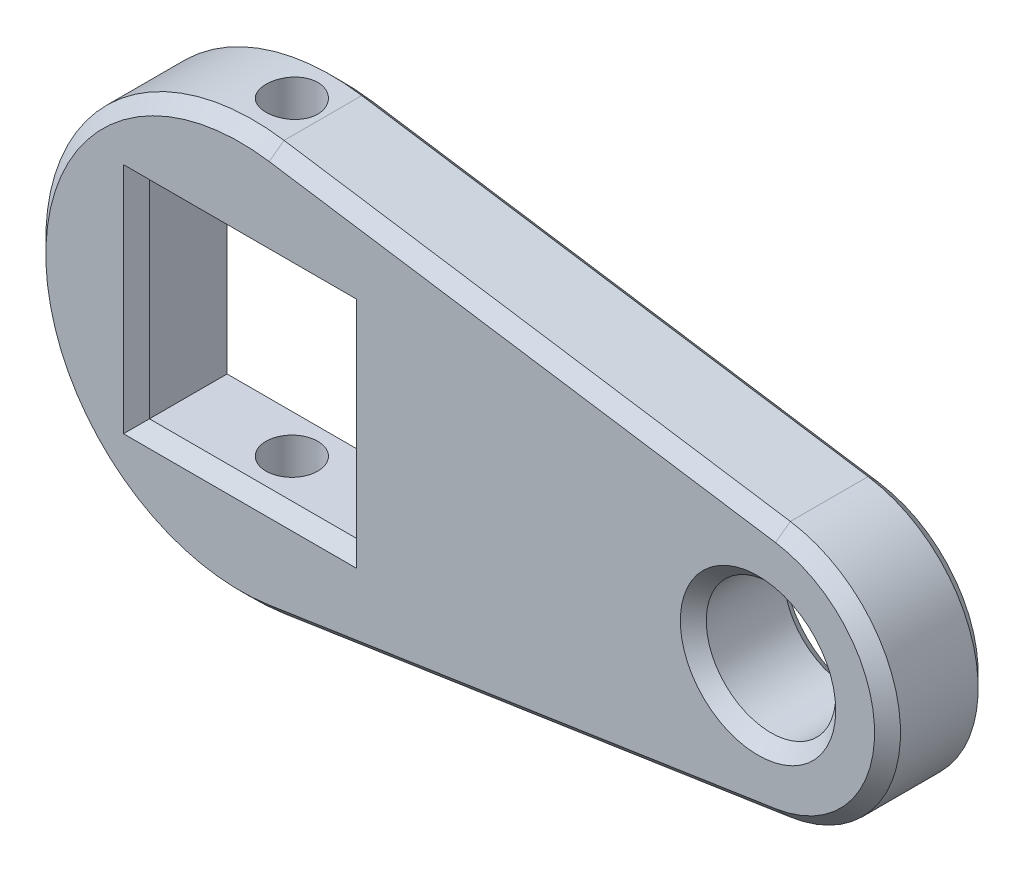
ISO-10303-21;
HEADER;
FILE_DESCRIPTION(('STEP AP214'),'2;1');
FILE_NAME('part.step','',(''),(''),'','','');
FILE_SCHEMA(('AUTOMOTIVE_DESIGN { 1 0 10303 214 1 1 1 1 }'));
ENDSEC;
DATA;
#1=APPLICATION_CONTEXT('core data for automotive mechanical design processes');
#2=APPLICATION_PROTOCOL_DEFINITION('international standard','automotive_design',2000,#1);
#3=PRODUCT_CONTEXT('',#1,'mechanical');
#4=PRODUCT('Part','Part','',(#3));
#5=PRODUCT_RELATED_PRODUCT_CATEGORY('part','',(#4));
#6=PRODUCT_DEFINITION_FORMATION('','',#4);
#7=PRODUCT_DEFINITION_CONTEXT('part definition',#1,'design');
#8=PRODUCT_DEFINITION('design','',#6,#7);
#9=PRODUCT_DEFINITION_SHAPE('','',#8);
#10=(LENGTH_UNIT() NAMED_UNIT(*) SI_UNIT(.MILLI.,.METRE.));
#11=(NAMED_UNIT(*) PLANE_ANGLE_UNIT() SI_UNIT($,.RADIAN.));
#12=(NAMED_UNIT(*) SI_UNIT($,.STERADIAN.) SOLID_ANGLE_UNIT());
#13=UNCERTAINTY_MEASURE_WITH_UNIT(LENGTH_MEASURE(1.E-05),#10,'distance_accuracy_value','');
#14=(GEOMETRIC_REPRESENTATION_CONTEXT(3) GLOBAL_UNCERTAINTY_ASSIGNED_CONTEXT((#13)) GLOBAL_UNIT_ASSIGNED_CONTEXT((#10,
#11,#12)) REPRESENTATION_CONTEXT('',''));
#15=CARTESIAN_POINT('',(0.,0.,0.));
#16=DIRECTION('',(0.,0.,1.));
#17=DIRECTION('',(1.,0.,0.));
#18=AXIS2_PLACEMENT_3D('',#15,#16,#17);
#19=CARTESIAN_POINT('',(20.,0.,2.));
#20=DIRECTION('',(0.,0.,1.));
#21=DIRECTION('',(1.,0.,0.));
#22=AXIS2_PLACEMENT_3D('',#19,#20,#21);
#23=PLANE('',#22);
#24=CARTESIAN_POINT('',(20.,0.,2.));
#25=DIRECTION('',(0.,0.,1.));
#26=DIRECTION('',(1.,0.,0.));
#27=AXIS2_PLACEMENT_3D('',#24,#25,#26);
#28=CIRCLE('',#27,3.);
#29=CARTESIAN_POINT('',(23.,0.,2.));
#30=VERTEX_POINT('',#29);
#31=EDGE_CURVE('E11',#30,#30,#28,.F.);
#32=ORIENTED_EDGE('',*,*,#31,.T.);
#33=EDGE_LOOP('',(#32));
#34=FACE_BOUND('',#33,.T.);
#35=CARTESIAN_POINT('',(0.,0.,2.));
#36=DIRECTION('',(0.,0.,1.));
#37=DIRECTION('',(1.,0.,0.));
#38=AXIS2_PLACEMENT_3D('',#35,#36,#37);
#39=CIRCLE('',#38,7.50000000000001);
#40=CARTESIAN_POINT('',(1.125,7.41514497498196,2.));
#41=VERTEX_POINT('',#40);
#42=CARTESIAN_POINT('',(1.125,-7.41514497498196,2.));
#43=VERTEX_POINT('',#42);
#44=EDGE_CURVE('E52',#41,#43,#39,.T.);
#45=ORIENTED_EDGE('',*,*,#44,.T.);
#46=DIRECTION('',(0.98868599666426,0.15,0.));
#47=VECTOR('',#46,1.);
#48=CARTESIAN_POINT('',(20.675,-4.44908698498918,2.));
#49=LINE('',#48,#47);
#50=CARTESIAN_POINT('',(20.675,-4.44908698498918,2.));
#51=VERTEX_POINT('',#50);
#52=EDGE_CURVE('E44',#43,#51,#49,.T.);
#53=ORIENTED_EDGE('',*,*,#52,.T.);
#54=CARTESIAN_POINT('',(20.,0.,2.));
#55=DIRECTION('',(0.,0.,1.));
#56=DIRECTION('',(1.,0.,0.));
#57=AXIS2_PLACEMENT_3D('',#54,#55,#56);
#58=CIRCLE('',#57,4.50000000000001);
#59=CARTESIAN_POINT('',(20.675,4.44908698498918,2.));
#60=VERTEX_POINT('',#59);
#61=EDGE_CURVE('E242',#51,#60,#58,.T.);
#62=ORIENTED_EDGE('',*,*,#61,.T.);
#63=DIRECTION('',(-0.98868599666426,0.15,0.));
#64=VECTOR('',#63,1.);
#65=CARTESIAN_POINT('',(1.125,7.41514497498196,2.));
#66=LINE('',#65,#64);
#67=EDGE_CURVE('E57',#60,#41,#66,.T.);
#68=ORIENTED_EDGE('',*,*,#67,.T.);
#69=EDGE_LOOP('',(#45,#53,#62,#68));
#70=FACE_BOUND('',#69,.T.);
#71=DIRECTION('',(1.,0.,0.));
#72=VECTOR('',#71,1.);
#73=CARTESIAN_POINT('',(20.,4.50000000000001,2.));
#74=LINE('',#73,#72);
#75=CARTESIAN_POINT('',(-4.50000000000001,4.50000000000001,2.));
#76=VERTEX_POINT('',#75);
#77=CARTESIAN_POINT('',(4.50000000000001,4.50000000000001,2.));
#78=VERTEX_POINT('',#77);
#79=EDGE_CURVE('E237',#76,#78,#74,.T.);
#80=ORIENTED_EDGE('',*,*,#79,.T.);
#81=DIRECTION('',(0.,-1.,0.));
#82=VECTOR('',#81,1.);
#83=CARTESIAN_POINT('',(4.50000000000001,0.,2.));
#84=LINE('',#83,#82);
#85=CARTESIAN_POINT('',(4.50000000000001,-4.50000000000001,2.));
#86=VERTEX_POINT('',#85);
#87=EDGE_CURVE('E239',#78,#86,#84,.T.);
#88=ORIENTED_EDGE('',*,*,#87,.T.);
#89=DIRECTION('',(-1.,0.,0.));
#90=VECTOR('',#89,1.);
#91=CARTESIAN_POINT('',(20.,-4.5,2.));
#92=LINE('',#91,#90);
#93=CARTESIAN_POINT('',(-4.50000000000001,-4.50000000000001,2.));
#94=VERTEX_POINT('',#93);
#95=EDGE_CURVE('E233',#86,#94,#92,.T.);
#96=ORIENTED_EDGE('',*,*,#95,.T.);
#97=DIRECTION('',(0.,1.,0.));
#98=VECTOR('',#97,1.);
#99=CARTESIAN_POINT('',(-4.50000000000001,0.,2.));
#100=LINE('',#99,#98);
#101=EDGE_CURVE('E235',#94,#76,#100,.T.);
#102=ORIENTED_EDGE('',*,*,#101,.T.);
#103=EDGE_LOOP('',(#80,#88,#96,#102));
#104=FACE_BOUND('',#103,.T.);
#105=ADVANCED_FACE('F35',(#34,#70,#104),#23,.T.);
#106=CARTESIAN_POINT('',(20.,0.,-2.));
#107=DIRECTION('',(0.,0.,1.));
#108=DIRECTION('',(1.,0.,0.));
#109=AXIS2_PLACEMENT_3D('',#106,#107,#108);
#110=PLANE('',#109);
#111=CARTESIAN_POINT('',(20.,0.,-2.));
#112=DIRECTION('',(0.,0.,1.));
#113=DIRECTION('',(1.,0.,0.));
#114=AXIS2_PLACEMENT_3D('',#111,#112,#113);
#115=CIRCLE('',#114,2.99999999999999);
#116=CARTESIAN_POINT('',(23.,0.,-2.));
#117=VERTEX_POINT('',#116);
#118=EDGE_CURVE('E190',#117,#117,#115,.T.);
#119=ORIENTED_EDGE('',*,*,#118,.T.);
#120=EDGE_LOOP('',(#119));
#121=FACE_BOUND('',#120,.T.);
#122=DIRECTION('',(0.,1.,0.));
#123=VECTOR('',#122,1.);
#124=CARTESIAN_POINT('',(4.5,4.,-2.));
#125=LINE('',#124,#123);
#126=CARTESIAN_POINT('',(4.5,-4.5,-2.));
#127=VERTEX_POINT('',#126);
#128=CARTESIAN_POINT('',(4.5,4.5,-2.));
#129=VERTEX_POINT('',#128);
#130=EDGE_CURVE('E185',#127,#129,#125,.T.);
#131=ORIENTED_EDGE('',*,*,#130,.T.);
#132=DIRECTION('',(-1.,0.,0.));
#133=VECTOR('',#132,1.);
#134=CARTESIAN_POINT('',(-4.,4.5,-2.));
#135=LINE('',#134,#133);
#136=CARTESIAN_POINT('',(-4.5,4.5,-2.));
#137=VERTEX_POINT('',#136);
#138=EDGE_CURVE('E187',#129,#137,#135,.T.);
#139=ORIENTED_EDGE('',*,*,#138,.T.);
#140=DIRECTION('',(0.,-1.,0.));
#141=VECTOR('',#140,1.);
#142=CARTESIAN_POINT('',(-4.5,-4.,-2.));
#143=LINE('',#142,#141);
#144=CARTESIAN_POINT('',(-4.5,-4.5,-2.));
#145=VERTEX_POINT('',#144);
#146=EDGE_CURVE('E177',#137,#145,#143,.T.);
#147=ORIENTED_EDGE('',*,*,#146,.T.);
#148=DIRECTION('',(1.,0.,0.));
#149=VECTOR('',#148,1.);
#150=CARTESIAN_POINT('',(4.,-4.5,-2.));
#151=LINE('',#150,#149);
#152=EDGE_CURVE('E179',#145,#127,#151,.T.);
#153=ORIENTED_EDGE('',*,*,#152,.T.);
#154=EDGE_LOOP('',(#131,#139,#147,#153));
#155=FACE_BOUND('',#154,.T.);
#156=CARTESIAN_POINT('',(0.,0.,-2.));
#157=DIRECTION('',(0.,0.,1.));
#158=DIRECTION('',(1.,0.,0.));
#159=AXIS2_PLACEMENT_3D('',#156,#157,#158);
#160=CIRCLE('',#159,7.5);
#161=CARTESIAN_POINT('',(1.125,-7.41514497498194,-2.));
#162=VERTEX_POINT('',#161);
#163=CARTESIAN_POINT('',(1.125,7.41514497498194,-2.));
#164=VERTEX_POINT('',#163);
#165=EDGE_CURVE('E176',#162,#164,#160,.F.);
#166=ORIENTED_EDGE('',*,*,#165,.T.);
#167=DIRECTION('',(0.98868599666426,-0.15,0.));
#168=VECTOR('',#167,1.);
#169=CARTESIAN_POINT('',(20.675,4.44908698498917,-2.));
#170=LINE('',#169,#168);
#171=CARTESIAN_POINT('',(20.675,4.44908698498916,-2.));
#172=VERTEX_POINT('',#171);
#173=EDGE_CURVE('E155',#164,#172,#170,.T.);
#174=ORIENTED_EDGE('',*,*,#173,.T.);
#175=CARTESIAN_POINT('',(20.,0.,-2.));
#176=DIRECTION('',(0.,0.,1.));
#177=DIRECTION('',(1.,0.,0.));
#178=AXIS2_PLACEMENT_3D('',#175,#176,#177);
#179=CIRCLE('',#178,4.5);
#180=CARTESIAN_POINT('',(20.675,-4.44908698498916,-2.));
#181=VERTEX_POINT('',#180);
#182=EDGE_CURVE('E165',#172,#181,#179,.F.);
#183=ORIENTED_EDGE('',*,*,#182,.T.);
#184=DIRECTION('',(-0.98868599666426,-0.15,0.));
#185=VECTOR('',#184,1.);
#186=CARTESIAN_POINT('',(20.675,-4.44908698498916,-2.));
#187=LINE('',#186,#185);
#188=EDGE_CURVE('E171',#181,#162,#187,.T.);
#189=ORIENTED_EDGE('',*,*,#188,.T.);
#190=EDGE_LOOP('',(#166,#174,#183,#189));
#191=FACE_BOUND('',#190,.T.);
#192=ADVANCED_FACE('F174',(#121,#155,#191),#110,.F.);
#193=CARTESIAN_POINT('',(20.,0.,2.));
#194=DIRECTION('',(0.,0.,-1.));
#195=DIRECTION('',(-1.,0.,0.));
#196=AXIS2_PLACEMENT_3D('',#193,#194,#195);
#197=CYLINDRICAL_SURFACE('',#196,5.);
#198=DIRECTION('',(0.,0.,-1.));
#199=VECTOR('',#198,1.);
#200=CARTESIAN_POINT('',(20.75,-4.9434299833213,2.));
#201=LINE('',#200,#199);
#202=CARTESIAN_POINT('',(20.75,-4.9434299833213,1.5));
#203=VERTEX_POINT('',#202);
#204=CARTESIAN_POINT('',(20.75,-4.9434299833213,-1.5));
#205=VERTEX_POINT('',#204);
#206=EDGE_CURVE('E321',#203,#205,#201,.T.);
#207=ORIENTED_EDGE('',*,*,#206,.T.);
#208=CARTESIAN_POINT('',(20.,0.,-1.5));
#209=DIRECTION('',(0.,0.,1.));
#210=DIRECTION('',(1.,0.,0.));
#211=AXIS2_PLACEMENT_3D('',#208,#209,#210);
#212=CIRCLE('',#211,5.);
#213=CARTESIAN_POINT('',(20.75,4.9434299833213,-1.5));
#214=VERTEX_POINT('',#213);
#215=EDGE_CURVE('E231',#205,#214,#212,.T.);
#216=ORIENTED_EDGE('',*,*,#215,.T.);
#217=DIRECTION('',(0.,0.,-1.));
#218=VECTOR('',#217,1.);
#219=CARTESIAN_POINT('',(20.75,4.9434299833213,2.));
#220=LINE('',#219,#218);
#221=CARTESIAN_POINT('',(20.75,4.9434299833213,1.5));
#222=VERTEX_POINT('',#221);
#223=EDGE_CURVE('E172',#222,#214,#220,.T.);
#224=ORIENTED_EDGE('',*,*,#223,.F.);
#225=CARTESIAN_POINT('',(20.,0.,1.5));
#226=DIRECTION('',(0.,0.,1.));
#227=DIRECTION('',(1.,0.,0.));
#228=AXIS2_PLACEMENT_3D('',#225,#226,#227);
#229=CIRCLE('',#228,5.);
#230=EDGE_CURVE('E229',#222,#203,#229,.F.);
#231=ORIENTED_EDGE('',*,*,#230,.T.);
#232=EDGE_LOOP('',(#207,#216,#224,#231));
#233=FACE_BOUND('',#232,.T.);
#234=ADVANCED_FACE('F371',(#233),#197,.T.);
#235=CARTESIAN_POINT('',(1.2,7.90948797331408,2.));
#236=DIRECTION('',(-0.15,-0.988685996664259,0.));
#237=DIRECTION('',(0.98868599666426,-0.15,0.));
#238=AXIS2_PLACEMENT_3D('',#235,#236,#237);
#239=PLANE('',#238);
#240=ORIENTED_EDGE('',*,*,#223,.T.);
#241=DIRECTION('',(-0.98868599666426,0.15,0.));
#242=VECTOR('',#241,1.);
#243=CARTESIAN_POINT('',(1.2,7.90948797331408,-1.5));
#244=LINE('',#243,#242);
#245=CARTESIAN_POINT('',(1.2,7.90948797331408,-1.5));
#246=VERTEX_POINT('',#245);
#247=EDGE_CURVE('E158',#214,#246,#244,.T.);
#248=ORIENTED_EDGE('',*,*,#247,.T.);
#249=DIRECTION('',(0.,0.,-1.));
#250=VECTOR('',#249,1.);
#251=CARTESIAN_POINT('',(1.2,7.90948797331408,2.));
#252=LINE('',#251,#250);
#253=CARTESIAN_POINT('',(1.2,7.90948797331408,1.5));
#254=VERTEX_POINT('',#253);
#255=EDGE_CURVE('E327',#254,#246,#252,.T.);
#256=ORIENTED_EDGE('',*,*,#255,.F.);
#257=DIRECTION('',(0.98868599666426,-0.15,0.));
#258=VECTOR('',#257,1.);
#259=CARTESIAN_POINT('',(20.75,4.9434299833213,1.5));
#260=LINE('',#259,#258);
#261=EDGE_CURVE('E217',#254,#222,#260,.T.);
#262=ORIENTED_EDGE('',*,*,#261,.T.);
#263=EDGE_LOOP('',(#240,#248,#256,#262));
#264=FACE_BOUND('',#263,.T.);
#265=ADVANCED_FACE('F345',(#264),#239,.F.);
#266=CARTESIAN_POINT('',(0.,0.,2.));
#267=DIRECTION('',(0.,0.,-1.));
#268=DIRECTION('',(-1.,0.,0.));
#269=AXIS2_PLACEMENT_3D('',#266,#267,#268);
#270=CYLINDRICAL_SURFACE('',#269,8.);
#271=CARTESIAN_POINT('',(0.,-8.,1.));
#272=CARTESIAN_POINT('',(0.0559364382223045,-7.99999921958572,0.999997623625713));
#273=CARTESIAN_POINT('',(0.111907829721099,-7.99940713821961,0.995290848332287));
#274=CARTESIAN_POINT('',(0.222293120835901,-7.99710216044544,0.976588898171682));
#275=CARTESIAN_POINT('',(0.276705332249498,-7.99538809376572,0.962584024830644));
#276=CARTESIAN_POINT('',(0.382358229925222,-7.99103224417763,0.925704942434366));
#277=CARTESIAN_POINT('',(0.433601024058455,-7.98839108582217,0.902836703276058));
#278=CARTESIAN_POINT('',(0.531511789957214,-7.98247480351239,0.848893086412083));
#279=CARTESIAN_POINT('',(0.578180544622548,-7.97919978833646,0.817819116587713));
#280=CARTESIAN_POINT('',(0.665885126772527,-7.9723612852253,0.748163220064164));
#281=CARTESIAN_POINT('',(0.706892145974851,-7.96879645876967,0.709545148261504));
#282=CARTESIAN_POINT('',(0.781861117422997,-7.961790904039,0.625974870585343));
#283=CARTESIAN_POINT('',(0.8158227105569,-7.95835018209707,0.581022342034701));
#284=CARTESIAN_POINT('',(0.875844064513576,-7.95196922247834,0.485872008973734));
#285=CARTESIAN_POINT('',(0.901876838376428,-7.94903070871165,0.435657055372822));
#286=CARTESIAN_POINT('',(0.945129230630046,-7.94400451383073,0.331525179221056));
#287=CARTESIAN_POINT('',(0.962349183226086,-7.94191680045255,0.277608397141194));
#288=CARTESIAN_POINT('',(0.987399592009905,-7.93884135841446,0.167902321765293));
#289=CARTESIAN_POINT('',(0.99527868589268,-7.93784793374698,0.112124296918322));
#290=CARTESIAN_POINT('',(1.00157421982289,-7.93705611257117,2.94946112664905E-05));
#291=CARTESIAN_POINT('',(0.999991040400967,-7.93725766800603,-0.0562872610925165));
#292=CARTESIAN_POINT('',(0.987446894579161,-7.93882782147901,-0.167521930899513));
#293=CARTESIAN_POINT('',(0.976539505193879,-7.94018975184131,-0.222445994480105));
#294=CARTESIAN_POINT('',(0.945740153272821,-7.94391679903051,-0.329678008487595));
#295=CARTESIAN_POINT('',(0.925848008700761,-7.94628193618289,-0.381985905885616));
#296=CARTESIAN_POINT('',(0.87758622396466,-7.95175646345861,-0.482667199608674));
#297=CARTESIAN_POINT('',(0.849193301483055,-7.95486789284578,-0.531029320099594));
#298=CARTESIAN_POINT('',(0.784752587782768,-7.96148284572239,-0.622322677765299));
#299=CARTESIAN_POINT('',(0.74870444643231,-7.96498638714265,-0.665253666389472));
#300=CARTESIAN_POINT('',(0.669679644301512,-7.9720204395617,-0.744777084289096));
#301=CARTESIAN_POINT('',(0.626656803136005,-7.97555096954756,-0.781323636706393));
#302=CARTESIAN_POINT('',(0.535062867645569,-7.98221853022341,-0.846683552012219));
#303=CARTESIAN_POINT('',(0.486491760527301,-7.98535556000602,-0.8754968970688));
#304=CARTESIAN_POINT('',(0.385144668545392,-7.99088460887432,-0.924572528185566));
#305=CARTESIAN_POINT('',(0.332367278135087,-7.99327637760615,-0.944831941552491));
#306=CARTESIAN_POINT('',(0.224123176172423,-7.99704314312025,-0.976188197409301));
#307=CARTESIAN_POINT('',(0.168656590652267,-7.99841818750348,-0.98728546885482));
#308=CARTESIAN_POINT('',(0.0570052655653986,-7.99999038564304,-0.999942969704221));
#309=CARTESIAN_POINT('',(0.000827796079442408,-8.00019534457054,-1.00156639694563));
#310=CARTESIAN_POINT('',(-0.110998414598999,-7.99942535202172,-0.99539690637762));
#311=CARTESIAN_POINT('',(-0.166647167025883,-7.99845042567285,-0.987604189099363));
#312=CARTESIAN_POINT('',(-0.275649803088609,-7.99543507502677,-0.962876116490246));
#313=CARTESIAN_POINT('',(-0.329010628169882,-7.99339816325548,-0.945970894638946));
#314=CARTESIAN_POINT('',(-0.432139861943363,-7.98848689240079,-0.903529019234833));
#315=CARTESIAN_POINT('',(-0.481908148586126,-7.98561250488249,-0.877992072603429));
#316=CARTESIAN_POINT('',(-0.576721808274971,-7.97932729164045,-0.818858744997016));
#317=CARTESIAN_POINT('',(-0.621741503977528,-7.97591377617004,-0.785221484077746));
#318=CARTESIAN_POINT('',(-0.705518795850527,-7.96894056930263,-0.710900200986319));
#319=CARTESIAN_POINT('',(-0.744276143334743,-7.9653808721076,-0.670215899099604));
#320=CARTESIAN_POINT('',(-0.814652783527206,-7.95849242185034,-0.582677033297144));
#321=CARTESIAN_POINT('',(-0.846230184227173,-7.95516509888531,-0.535788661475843));
#322=CARTESIAN_POINT('',(-0.901061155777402,-7.94914164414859,-0.437336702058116));
#323=CARTESIAN_POINT('',(-0.924314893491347,-7.94644549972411,-0.385773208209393));
#324=CARTESIAN_POINT('',(-0.961770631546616,-7.94199940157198,-0.279569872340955));
#325=CARTESIAN_POINT('',(-0.975996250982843,-7.94024698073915,-0.224938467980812));
#326=CARTESIAN_POINT('',(-0.995067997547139,-7.93787966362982,-0.114039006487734));
#327=CARTESIAN_POINT('',(-0.999914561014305,-7.93726471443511,-0.0577710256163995));
#328=CARTESIAN_POINT('',(-1.00008261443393,-7.93724350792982,0.0543875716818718));
#329=CARTESIAN_POINT('',(-0.99546991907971,-7.93782889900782,0.110278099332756));
#330=CARTESIAN_POINT('',(-0.97698976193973,-7.94012445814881,0.220482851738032));
#331=CARTESIAN_POINT('',(-0.963122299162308,-7.94183462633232,0.274797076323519));
#332=CARTESIAN_POINT('',(-0.926546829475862,-7.9461844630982,0.38029878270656));
#333=CARTESIAN_POINT('',(-0.903841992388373,-7.94882379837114,0.431487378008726));
#334=CARTESIAN_POINT('',(-0.850242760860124,-7.95473513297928,0.529338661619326));
#335=CARTESIAN_POINT('',(-0.819348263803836,-7.95800714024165,0.576001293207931));
#336=CARTESIAN_POINT('',(-0.750002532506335,-7.96484241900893,0.66381249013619));
#337=CARTESIAN_POINT('',(-0.711502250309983,-7.96840748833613,0.704922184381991));
#338=CARTESIAN_POINT('',(-0.628140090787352,-7.9754113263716,0.780122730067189));
#339=CARTESIAN_POINT('',(-0.583276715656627,-7.97885006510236,0.814211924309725));
#340=CARTESIAN_POINT('',(-0.488266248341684,-7.98522822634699,0.874514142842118));
#341=CARTESIAN_POINT('',(-0.438099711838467,-7.98816570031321,0.900696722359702));
#342=CARTESIAN_POINT('',(-0.334073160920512,-7.9931905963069,0.944228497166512));
#343=CARTESIAN_POINT('',(-0.280217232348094,-7.9952789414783,0.961587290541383));
#344=CARTESIAN_POINT('',(-0.18840230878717,-7.99786688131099,0.982823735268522));
#345=CARTESIAN_POINT('',(-0.151022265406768,-7.99866290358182,0.989255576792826));
#346=CARTESIAN_POINT('',(-0.075766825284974,-7.99972972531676,0.997844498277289));
#347=CARTESIAN_POINT('',(-0.037891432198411,-8.00000052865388,1.00000160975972));
#348=CARTESIAN_POINT('',(0.,-8.,1.));
#349=B_SPLINE_CURVE_WITH_KNOTS('',3,(#271,#272,#273,#274,#275,#276,#277,#278,#279,#280,#281,
#282,#283,#284,#285,#286,#287,#288,#289,#290,#291,#292,#293,#294,#295,#296,#297,#298,#299,#300,
#301,#302,#303,#304,#305,#306,#307,#308,#309,#310,#311,#312,#313,#314,#315,#316,#317,#318,#319,
#320,#321,#322,#323,#324,#325,#326,#327,#328,#329,#330,#331,#332,#333,#334,#335,#336,#337,#338,
#339,#340,#341,#342,#343,#344,#345,#346,#347,#348),.UNSPECIFIED.,.T.,.F.,(4,2,2,2,2,2,2,2,2,2,2,
2,2,2,2,2,2,2,2,2,2,2,2,2,2,2,2,2,2,2,2,2,2,2,2,2,2,2,4),(0.,0.167670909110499,
0.335516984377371,0.503250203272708,0.670954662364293,0.839483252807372,1.00802043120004,
1.17712500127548,1.34622315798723,1.51443690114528,1.68264387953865,1.84989078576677,
2.01714108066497,2.18485370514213,2.35257400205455,2.52145391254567,2.69033421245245,
2.85927118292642,3.02820024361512,3.19600111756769,3.36379841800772,3.53104421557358,
3.69829569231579,3.86640961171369,4.03453020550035,4.20360788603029,4.37268217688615,
4.5413122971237,4.70993457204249,4.87738760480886,5.04484065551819,5.21223369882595,
5.37962883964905,5.54814095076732,5.71669279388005,5.88588561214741,6.05489399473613,
6.16847537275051,6.28205591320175),.UNSPECIFIED.);
#350=CARTESIAN_POINT('',(0.,-8.,1.));
#351=VERTEX_POINT('',#350);
#352=EDGE_CURVE('E315',#351,#351,#349,.T.);
#353=ORIENTED_EDGE('',*,*,#352,.T.);
#354=EDGE_LOOP('',(#353));
#355=FACE_BOUND('',#354,.T.);
#356=CARTESIAN_POINT('',(0.,8.,1.));
#357=CARTESIAN_POINT('',(-0.0559364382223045,7.99999921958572,0.999997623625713));
#358=CARTESIAN_POINT('',(-0.111907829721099,7.99940713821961,0.995290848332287));
#359=CARTESIAN_POINT('',(-0.222293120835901,7.99710216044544,0.976588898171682));
#360=CARTESIAN_POINT('',(-0.276705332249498,7.99538809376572,0.962584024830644));
#361=CARTESIAN_POINT('',(-0.382358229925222,7.99103224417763,0.925704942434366));
#362=CARTESIAN_POINT('',(-0.433601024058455,7.98839108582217,0.902836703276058));
#363=CARTESIAN_POINT('',(-0.531511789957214,7.98247480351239,0.848893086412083));
#364=CARTESIAN_POINT('',(-0.578180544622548,7.97919978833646,0.817819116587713));
#365=CARTESIAN_POINT('',(-0.665885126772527,7.9723612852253,0.748163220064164));
#366=CARTESIAN_POINT('',(-0.706892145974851,7.96879645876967,0.709545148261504));
#367=CARTESIAN_POINT('',(-0.781861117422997,7.961790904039,0.625974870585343));
#368=CARTESIAN_POINT('',(-0.8158227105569,7.95835018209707,0.581022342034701));
#369=CARTESIAN_POINT('',(-0.875844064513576,7.95196922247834,0.485872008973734));
#370=CARTESIAN_POINT('',(-0.901876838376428,7.94903070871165,0.435657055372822));
#371=CARTESIAN_POINT('',(-0.945129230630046,7.94400451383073,0.331525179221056));
#372=CARTESIAN_POINT('',(-0.962349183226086,7.94191680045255,0.277608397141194));
#373=CARTESIAN_POINT('',(-0.987399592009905,7.93884135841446,0.167902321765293));
#374=CARTESIAN_POINT('',(-0.99527868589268,7.93784793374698,0.112124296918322));
#375=CARTESIAN_POINT('',(-1.00157421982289,7.93705611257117,2.94946112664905E-05));
#376=CARTESIAN_POINT('',(-0.999991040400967,7.93725766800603,-0.0562872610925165));
#377=CARTESIAN_POINT('',(-0.987446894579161,7.93882782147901,-0.167521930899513));
#378=CARTESIAN_POINT('',(-0.976539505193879,7.94018975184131,-0.222445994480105));
#379=CARTESIAN_POINT('',(-0.945740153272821,7.94391679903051,-0.329678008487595));
#380=CARTESIAN_POINT('',(-0.925848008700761,7.94628193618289,-0.381985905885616));
#381=CARTESIAN_POINT('',(-0.87758622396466,7.95175646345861,-0.482667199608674));
#382=CARTESIAN_POINT('',(-0.849193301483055,7.95486789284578,-0.531029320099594));
#383=CARTESIAN_POINT('',(-0.784752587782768,7.96148284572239,-0.622322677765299));
#384=CARTESIAN_POINT('',(-0.74870444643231,7.96498638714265,-0.665253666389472));
#385=CARTESIAN_POINT('',(-0.669679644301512,7.9720204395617,-0.744777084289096));
#386=CARTESIAN_POINT('',(-0.626656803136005,7.97555096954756,-0.781323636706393));
#387=CARTESIAN_POINT('',(-0.535062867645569,7.98221853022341,-0.846683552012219));
#388=CARTESIAN_POINT('',(-0.486491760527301,7.98535556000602,-0.8754968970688));
#389=CARTESIAN_POINT('',(-0.385144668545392,7.99088460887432,-0.924572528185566));
#390=CARTESIAN_POINT('',(-0.332367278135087,7.99327637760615,-0.944831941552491));
#391=CARTESIAN_POINT('',(-0.224123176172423,7.99704314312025,-0.976188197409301));
#392=CARTESIAN_POINT('',(-0.168656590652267,7.99841818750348,-0.98728546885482));
#393=CARTESIAN_POINT('',(-0.0570052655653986,7.99999038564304,-0.999942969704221));
#394=CARTESIAN_POINT('',(-0.000827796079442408,8.00019534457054,-1.00156639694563));
#395=CARTESIAN_POINT('',(0.110998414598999,7.99942535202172,-0.99539690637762));
#396=CARTESIAN_POINT('',(0.166647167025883,7.99845042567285,-0.987604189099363));
#397=CARTESIAN_POINT('',(0.275649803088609,7.99543507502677,-0.962876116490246));
#398=CARTESIAN_POINT('',(0.329010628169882,7.99339816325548,-0.945970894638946));
#399=CARTESIAN_POINT('',(0.432139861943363,7.98848689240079,-0.903529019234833));
#400=CARTESIAN_POINT('',(0.481908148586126,7.98561250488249,-0.877992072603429));
#401=CARTESIAN_POINT('',(0.576721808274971,7.97932729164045,-0.818858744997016));
#402=CARTESIAN_POINT('',(0.621741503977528,7.97591377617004,-0.785221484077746));
#403=CARTESIAN_POINT('',(0.705518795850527,7.96894056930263,-0.710900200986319));
#404=CARTESIAN_POINT('',(0.744276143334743,7.9653808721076,-0.670215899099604));
#405=CARTESIAN_POINT('',(0.814652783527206,7.95849242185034,-0.582677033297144));
#406=CARTESIAN_POINT('',(0.846230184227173,7.95516509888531,-0.535788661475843));
#407=CARTESIAN_POINT('',(0.901061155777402,7.94914164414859,-0.437336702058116));
#408=CARTESIAN_POINT('',(0.924314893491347,7.94644549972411,-0.385773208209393));
#409=CARTESIAN_POINT('',(0.961770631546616,7.94199940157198,-0.279569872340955));
#410=CARTESIAN_POINT('',(0.975996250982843,7.94024698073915,-0.224938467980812));
#411=CARTESIAN_POINT('',(0.995067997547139,7.93787966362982,-0.114039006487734));
#412=CARTESIAN_POINT('',(0.999914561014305,7.93726471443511,-0.0577710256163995));
#413=CARTESIAN_POINT('',(1.00008261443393,7.93724350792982,0.0543875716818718));
#414=CARTESIAN_POINT('',(0.99546991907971,7.93782889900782,0.110278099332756));
#415=CARTESIAN_POINT('',(0.97698976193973,7.94012445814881,0.220482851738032));
#416=CARTESIAN_POINT('',(0.963122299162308,7.94183462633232,0.274797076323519));
#417=CARTESIAN_POINT('',(0.926546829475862,7.9461844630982,0.38029878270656));
#418=CARTESIAN_POINT('',(0.903841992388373,7.94882379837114,0.431487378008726));
#419=CARTESIAN_POINT('',(0.850242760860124,7.95473513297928,0.529338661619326));
#420=CARTESIAN_POINT('',(0.819348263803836,7.95800714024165,0.576001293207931));
#421=CARTESIAN_POINT('',(0.750002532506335,7.96484241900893,0.66381249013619));
#422=CARTESIAN_POINT('',(0.711502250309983,7.96840748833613,0.704922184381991));
#423=CARTESIAN_POINT('',(0.628140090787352,7.9754113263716,0.780122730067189));
#424=CARTESIAN_POINT('',(0.583276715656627,7.97885006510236,0.814211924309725));
#425=CARTESIAN_POINT('',(0.488266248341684,7.98522822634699,0.874514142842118));
#426=CARTESIAN_POINT('',(0.438099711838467,7.98816570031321,0.900696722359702));
#427=CARTESIAN_POINT('',(0.334073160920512,7.9931905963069,0.944228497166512));
#428=CARTESIAN_POINT('',(0.280217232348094,7.9952789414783,0.961587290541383));
#429=CARTESIAN_POINT('',(0.18840230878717,7.99786688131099,0.982823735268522));
#430=CARTESIAN_POINT('',(0.151022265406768,7.99866290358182,0.989255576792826));
#431=CARTESIAN_POINT('',(0.075766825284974,7.99972972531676,0.997844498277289));
#432=CARTESIAN_POINT('',(0.037891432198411,8.00000052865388,1.00000160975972));
#433=CARTESIAN_POINT('',(0.,8.,1.));
#434=B_SPLINE_CURVE_WITH_KNOTS('',3,(#356,#357,#358,#359,#360,#361,#362,#363,#364,#365,#366,
#367,#368,#369,#370,#371,#372,#373,#374,#375,#376,#377,#378,#379,#380,#381,#382,#383,#384,#385,
#386,#387,#388,#389,#390,#391,#392,#393,#394,#395,#396,#397,#398,#399,#400,#401,#402,#403,#404,
#405,#406,#407,#408,#409,#410,#411,#412,#413,#414,#415,#416,#417,#418,#419,#420,#421,#422,#423,
#424,#425,#426,#427,#428,#429,#430,#431,#432,#433),.UNSPECIFIED.,.T.,.F.,(4,2,2,2,2,2,2,2,2,2,2,
2,2,2,2,2,2,2,2,2,2,2,2,2,2,2,2,2,2,2,2,2,2,2,2,2,2,2,4),(0.,0.167670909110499,
0.335516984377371,0.503250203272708,0.670954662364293,0.839483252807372,1.00802043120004,
1.17712500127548,1.34622315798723,1.51443690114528,1.68264387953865,1.84989078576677,
2.01714108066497,2.18485370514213,2.35257400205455,2.52145391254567,2.69033421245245,
2.85927118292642,3.02820024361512,3.19600111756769,3.36379841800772,3.53104421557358,
3.69829569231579,3.86640961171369,4.03453020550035,4.20360788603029,4.37268217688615,
4.5413122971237,4.70993457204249,4.87738760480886,5.04484065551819,5.21223369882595,
5.37962883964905,5.54814095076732,5.71669279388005,5.88588561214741,6.05489399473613,
6.16847537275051,6.28205591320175),.UNSPECIFIED.);
#435=CARTESIAN_POINT('',(0.,8.,1.));
#436=VERTEX_POINT('',#435);
#437=EDGE_CURVE('E387',#436,#436,#434,.T.);
#438=ORIENTED_EDGE('',*,*,#437,.T.);
#439=EDGE_LOOP('',(#438));
#440=FACE_BOUND('',#439,.T.);
#441=ORIENTED_EDGE('',*,*,#255,.T.);
#442=CARTESIAN_POINT('',(0.,0.,-1.5));
#443=DIRECTION('',(0.,0.,1.));
#444=DIRECTION('',(1.,0.,0.));
#445=AXIS2_PLACEMENT_3D('',#442,#443,#444);
#446=CIRCLE('',#445,8.);
#447=CARTESIAN_POINT('',(1.2,-7.90948797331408,-1.5));
#448=VERTEX_POINT('',#447);
#449=EDGE_CURVE('E222',#246,#448,#446,.T.);
#450=ORIENTED_EDGE('',*,*,#449,.T.);
#451=DIRECTION('',(0.,0.,-1.));
#452=VECTOR('',#451,1.);
#453=CARTESIAN_POINT('',(1.2,-7.90948797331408,2.));
#454=LINE('',#453,#452);
#455=CARTESIAN_POINT('',(1.2,-7.90948797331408,1.5));
#456=VERTEX_POINT('',#455);
#457=EDGE_CURVE('E324',#456,#448,#454,.T.);
#458=ORIENTED_EDGE('',*,*,#457,.F.);
#459=CARTESIAN_POINT('',(0.,0.,1.5));
#460=DIRECTION('',(0.,0.,1.));
#461=DIRECTION('',(1.,0.,0.));
#462=AXIS2_PLACEMENT_3D('',#459,#460,#461);
#463=CIRCLE('',#462,8.);
#464=EDGE_CURVE('E220',#456,#254,#463,.F.);
#465=ORIENTED_EDGE('',*,*,#464,.T.);
#466=EDGE_LOOP('',(#441,#450,#458,#465));
#467=FACE_BOUND('',#466,.T.);
#468=ADVANCED_FACE('F348',(#355,#440,#467),#270,.T.);
#469=CARTESIAN_POINT('',(1.2,-7.90948797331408,2.));
#470=DIRECTION('',(-0.15,0.988685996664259,0.));
#471=DIRECTION('',(-0.98868599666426,-0.15,0.));
#472=AXIS2_PLACEMENT_3D('',#469,#470,#471);
#473=PLANE('',#472);
#474=ORIENTED_EDGE('',*,*,#457,.T.);
#475=DIRECTION('',(0.98868599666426,0.15,0.));
#476=VECTOR('',#475,1.);
#477=CARTESIAN_POINT('',(1.2,-7.90948797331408,-1.5));
#478=LINE('',#477,#476);
#479=EDGE_CURVE('E227',#448,#205,#478,.T.);
#480=ORIENTED_EDGE('',*,*,#479,.T.);
#481=ORIENTED_EDGE('',*,*,#206,.F.);
#482=DIRECTION('',(-0.98868599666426,-0.15,0.));
#483=VECTOR('',#482,1.);
#484=CARTESIAN_POINT('',(1.2,-7.90948797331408,1.5));
#485=LINE('',#484,#483);
#486=EDGE_CURVE('E224',#203,#456,#485,.T.);
#487=ORIENTED_EDGE('',*,*,#486,.T.);
#488=EDGE_LOOP('',(#474,#480,#481,#487));
#489=FACE_BOUND('',#488,.T.);
#490=ADVANCED_FACE('F356',(#489),#473,.F.);
#491=CARTESIAN_POINT('',(-4.,-4.,2.));
#492=DIRECTION('',(1.,0.,0.));
#493=DIRECTION('',(0.,0.,-1.));
#494=AXIS2_PLACEMENT_3D('',#491,#492,#493);
#495=PLANE('',#494);
#496=DIRECTION('',(0.,0.,-1.));
#497=VECTOR('',#496,1.);
#498=CARTESIAN_POINT('',(-4.,-4.,2.));
#499=LINE('',#498,#497);
#500=CARTESIAN_POINT('',(-4.,-4.,1.49999999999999));
#501=VERTEX_POINT('',#500);
#502=CARTESIAN_POINT('',(-4.,-4.,-1.5));
#503=VERTEX_POINT('',#502);
#504=EDGE_CURVE('E313',#501,#503,#499,.T.);
#505=ORIENTED_EDGE('',*,*,#504,.T.);
#506=DIRECTION('',(0.,1.,0.));
#507=VECTOR('',#506,1.);
#508=CARTESIAN_POINT('',(-4.,4.,-1.5));
#509=LINE('',#508,#507);
#510=CARTESIAN_POINT('',(-4.,4.,-1.5));
#511=VERTEX_POINT('',#510);
#512=EDGE_CURVE('E215',#503,#511,#509,.T.);
#513=ORIENTED_EDGE('',*,*,#512,.T.);
#514=DIRECTION('',(0.,0.,-1.));
#515=VECTOR('',#514,1.);
#516=CARTESIAN_POINT('',(-4.,4.,2.));
#517=LINE('',#516,#515);
#518=CARTESIAN_POINT('',(-4.,4.,1.49999999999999));
#519=VERTEX_POINT('',#518);
#520=EDGE_CURVE('E311',#519,#511,#517,.T.);
#521=ORIENTED_EDGE('',*,*,#520,.F.);
#522=DIRECTION('',(0.,-1.,0.));
#523=VECTOR('',#522,1.);
#524=CARTESIAN_POINT('',(-4.,-4.,1.49999999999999));
#525=LINE('',#524,#523);
#526=EDGE_CURVE('E213',#519,#501,#525,.T.);
#527=ORIENTED_EDGE('',*,*,#526,.T.);
#528=EDGE_LOOP('',(#505,#513,#521,#527));
#529=FACE_BOUND('',#528,.T.);
#530=ADVANCED_FACE('F375',(#529),#495,.T.);
#531=CARTESIAN_POINT('',(4.,-4.,2.));
#532=DIRECTION('',(0.,1.,0.));
#533=DIRECTION('',(-1.,0.,0.));
#534=AXIS2_PLACEMENT_3D('',#531,#532,#533);
#535=PLANE('',#534);
#536=CARTESIAN_POINT('',(0.,-4.,0.));
#537=DIRECTION('',(0.,1.,0.));
#538=DIRECTION('',(-1.,0.,0.));
#539=AXIS2_PLACEMENT_3D('',#536,#537,#538);
#540=CIRCLE('',#539,1.);
#541=CARTESIAN_POINT('',(-1.,-4.,0.));
#542=VERTEX_POINT('',#541);
#543=EDGE_CURVE('E333',#542,#542,#540,.T.);
#544=ORIENTED_EDGE('',*,*,#543,.F.);
#545=EDGE_LOOP('',(#544));
#546=FACE_BOUND('',#545,.T.);
#547=DIRECTION('',(0.,0.,-1.));
#548=VECTOR('',#547,1.);
#549=CARTESIAN_POINT('',(4.,-4.,2.));
#550=LINE('',#549,#548);
#551=CARTESIAN_POINT('',(4.,-4.,1.49999999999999));
#552=VERTEX_POINT('',#551);
#553=CARTESIAN_POINT('',(4.,-4.,-1.5));
#554=VERTEX_POINT('',#553);
#555=EDGE_CURVE('E308',#552,#554,#550,.T.);
#556=ORIENTED_EDGE('',*,*,#555,.T.);
#557=DIRECTION('',(-1.,0.,0.));
#558=VECTOR('',#557,1.);
#559=CARTESIAN_POINT('',(-4.,-4.,-1.5));
#560=LINE('',#559,#558);
#561=EDGE_CURVE('E211',#554,#503,#560,.T.);
#562=ORIENTED_EDGE('',*,*,#561,.T.);
#563=ORIENTED_EDGE('',*,*,#504,.F.);
#564=DIRECTION('',(1.,0.,0.));
#565=VECTOR('',#564,1.);
#566=CARTESIAN_POINT('',(4.,-4.,1.49999999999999));
#567=LINE('',#566,#565);
#568=EDGE_CURVE('E209',#501,#552,#567,.T.);
#569=ORIENTED_EDGE('',*,*,#568,.T.);
#570=EDGE_LOOP('',(#556,#562,#563,#569));
#571=FACE_BOUND('',#570,.T.);
#572=ADVANCED_FACE('F411',(#546,#571),#535,.T.);
#573=CARTESIAN_POINT('',(4.,-4.,2.));
#574=DIRECTION('',(-1.,0.,0.));
#575=DIRECTION('',(0.,0.,1.));
#576=AXIS2_PLACEMENT_3D('',#573,#574,#575);
#577=PLANE('',#576);
#578=DIRECTION('',(0.,0.,-1.));
#579=VECTOR('',#578,1.);
#580=CARTESIAN_POINT('',(4.,4.,2.));
#581=LINE('',#580,#579);
#582=CARTESIAN_POINT('',(4.,4.,1.49999999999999));
#583=VERTEX_POINT('',#582);
#584=CARTESIAN_POINT('',(4.,4.,-1.5));
#585=VERTEX_POINT('',#584);
#586=EDGE_CURVE('E306',#583,#585,#581,.T.);
#587=ORIENTED_EDGE('',*,*,#586,.T.);
#588=DIRECTION('',(0.,-1.,0.));
#589=VECTOR('',#588,1.);
#590=CARTESIAN_POINT('',(4.,-4.,-1.5));
#591=LINE('',#590,#589);
#592=EDGE_CURVE('E207',#585,#554,#591,.T.);
#593=ORIENTED_EDGE('',*,*,#592,.T.);
#594=ORIENTED_EDGE('',*,*,#555,.F.);
#595=DIRECTION('',(0.,1.,0.));
#596=VECTOR('',#595,1.);
#597=CARTESIAN_POINT('',(4.,-4.,1.49999999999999));
#598=LINE('',#597,#596);
#599=EDGE_CURVE('E204',#552,#583,#598,.T.);
#600=ORIENTED_EDGE('',*,*,#599,.T.);
#601=EDGE_LOOP('',(#587,#593,#594,#600));
#602=FACE_BOUND('',#601,.T.);
#603=ADVANCED_FACE('F305',(#602),#577,.T.);
#604=CARTESIAN_POINT('',(4.,4.,2.));
#605=DIRECTION('',(0.,-1.,0.));
#606=DIRECTION('',(1.,0.,0.));
#607=AXIS2_PLACEMENT_3D('',#604,#605,#606);
#608=PLANE('',#607);
#609=CARTESIAN_POINT('',(0.,4.,0.));
#610=DIRECTION('',(0.,-1.,0.));
#611=DIRECTION('',(1.,0.,0.));
#612=AXIS2_PLACEMENT_3D('',#609,#610,#611);
#613=CIRCLE('',#612,1.);
#614=CARTESIAN_POINT('',(1.,4.,0.));
#615=VERTEX_POINT('',#614);
#616=EDGE_CURVE('E257',#615,#615,#613,.T.);
#617=ORIENTED_EDGE('',*,*,#616,.F.);
#618=EDGE_LOOP('',(#617));
#619=FACE_BOUND('',#618,.T.);
#620=ORIENTED_EDGE('',*,*,#520,.T.);
#621=DIRECTION('',(1.,0.,0.));
#622=VECTOR('',#621,1.);
#623=CARTESIAN_POINT('',(4.,4.,-1.5));
#624=LINE('',#623,#622);
#625=EDGE_CURVE('E201',#511,#585,#624,.T.);
#626=ORIENTED_EDGE('',*,*,#625,.T.);
#627=ORIENTED_EDGE('',*,*,#586,.F.);
#628=DIRECTION('',(-1.,0.,0.));
#629=VECTOR('',#628,1.);
#630=CARTESIAN_POINT('',(4.,4.,1.49999999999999));
#631=LINE('',#630,#629);
#632=EDGE_CURVE('E199',#583,#519,#631,.T.);
#633=ORIENTED_EDGE('',*,*,#632,.T.);
#634=EDGE_LOOP('',(#620,#626,#627,#633));
#635=FACE_BOUND('',#634,.T.);
#636=ADVANCED_FACE('F309',(#619,#635),#608,.T.);
#637=CARTESIAN_POINT('',(20.,0.,2.));
#638=DIRECTION('',(0.,0.,-1.));
#639=DIRECTION('',(-1.,0.,0.));
#640=AXIS2_PLACEMENT_3D('',#637,#638,#639);
#641=CYLINDRICAL_SURFACE('',#640,2.5);
#642=CARTESIAN_POINT('',(20.,0.,-1.5));
#643=DIRECTION('',(0.,0.,1.));
#644=DIRECTION('',(1.,0.,0.));
#645=AXIS2_PLACEMENT_3D('',#642,#643,#644);
#646=CIRCLE('',#645,2.5);
#647=CARTESIAN_POINT('',(22.5,0.,-1.5));
#648=VERTEX_POINT('',#647);
#649=EDGE_CURVE('E196',#648,#648,#646,.F.);
#650=ORIENTED_EDGE('',*,*,#649,.T.);
#651=EDGE_LOOP('',(#650));
#652=FACE_BOUND('',#651,.T.);
#653=CARTESIAN_POINT('',(20.,0.,1.5));
#654=DIRECTION('',(0.,0.,1.));
#655=DIRECTION('',(1.,0.,0.));
#656=AXIS2_PLACEMENT_3D('',#653,#654,#655);
#657=CIRCLE('',#656,2.5);
#658=CARTESIAN_POINT('',(22.5,0.,1.5));
#659=VERTEX_POINT('',#658);
#660=EDGE_CURVE('E193',#659,#659,#657,.T.);
#661=ORIENTED_EDGE('',*,*,#660,.T.);
#662=EDGE_LOOP('',(#661));
#663=FACE_BOUND('',#662,.T.);
#664=ADVANCED_FACE('F402',(#652,#663),#641,.F.);
#665=CARTESIAN_POINT('',(0.,-22.,0.));
#666=DIRECTION('',(0.,1.,0.));
#667=DIRECTION('',(0.,0.,1.));
#668=AXIS2_PLACEMENT_3D('',#665,#666,#667);
#669=CYLINDRICAL_SURFACE('',#668,1.);
#670=ORIENTED_EDGE('',*,*,#616,.T.);
#671=EDGE_LOOP('',(#670));
#672=FACE_BOUND('',#671,.T.);
#673=ORIENTED_EDGE('',*,*,#437,.F.);
#674=EDGE_LOOP('',(#673));
#675=FACE_BOUND('',#674,.T.);
#676=ADVANCED_FACE('F400',(#672,#675),#669,.F.);
#677=ORIENTED_EDGE('',*,*,#543,.T.);
#678=EDGE_LOOP('',(#677));
#679=FACE_BOUND('',#678,.T.);
#680=ORIENTED_EDGE('',*,*,#352,.F.);
#681=EDGE_LOOP('',(#680));
#682=FACE_BOUND('',#681,.T.);
#683=ADVANCED_FACE('F395',(#679,#682),#669,.F.);
#684=CARTESIAN_POINT('',(20.,0.,-2.));
#685=DIRECTION('',(0.,0.,-1.));
#686=DIRECTION('',(-1.,0.,0.));
#687=AXIS2_PLACEMENT_3D('',#684,#685,#686);
#688=CONICAL_SURFACE('',#687,2.99999999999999,0.785398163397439);
#689=ORIENTED_EDGE('',*,*,#649,.F.);
#690=EDGE_LOOP('',(#689));
#691=FACE_BOUND('',#690,.T.);
#692=ORIENTED_EDGE('',*,*,#118,.F.);
#693=EDGE_LOOP('',(#692));
#694=FACE_BOUND('',#693,.T.);
#695=ADVANCED_FACE('F399',(#691,#694),#688,.F.);
#696=CARTESIAN_POINT('',(20.,-4.49999999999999,-2.));
#697=DIRECTION('',(0.,0.70710678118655,-0.707106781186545));
#698=DIRECTION('',(-1.,0.,0.));
#699=AXIS2_PLACEMENT_3D('',#696,#697,#698);
#700=PLANE('',#699);
#701=DIRECTION('',(-0.577350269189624,-0.577350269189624,-0.577350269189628));
#702=VECTOR('',#701,1.);
#703=CARTESIAN_POINT('',(3.66666666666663,3.66666666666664,6.16666666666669));
#704=LINE('',#703,#702);
#705=EDGE_CURVE('E251',#503,#145,#704,.T.);
#706=ORIENTED_EDGE('',*,*,#705,.F.);
#707=ORIENTED_EDGE('',*,*,#561,.F.);
#708=DIRECTION('',(0.577350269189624,-0.577350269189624,-0.577350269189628));
#709=VECTOR('',#708,1.);
#710=CARTESIAN_POINT('',(3.00000000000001,-3.,-0.499999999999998));
#711=LINE('',#710,#709);
#712=EDGE_CURVE('E254',#127,#554,#711,.F.);
#713=ORIENTED_EDGE('',*,*,#712,.F.);
#714=ORIENTED_EDGE('',*,*,#152,.F.);
#715=EDGE_LOOP('',(#706,#707,#713,#714));
#716=FACE_BOUND('',#715,.T.);
#717=ADVANCED_FACE('F426',(#716),#700,.T.);
#718=CARTESIAN_POINT('',(4.5,0.,-2.));
#719=DIRECTION('',(-0.70710678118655,0.,-0.707106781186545));
#720=DIRECTION('',(0.,-1.,0.));
#721=AXIS2_PLACEMENT_3D('',#718,#719,#720);
#722=PLANE('',#721);
#723=ORIENTED_EDGE('',*,*,#712,.T.);
#724=ORIENTED_EDGE('',*,*,#592,.F.);
#725=DIRECTION('',(0.577350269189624,0.577350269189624,-0.577350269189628));
#726=VECTOR('',#725,1.);
#727=CARTESIAN_POINT('',(9.66666666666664,9.66666666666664,-7.16666666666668));
#728=LINE('',#727,#726);
#729=EDGE_CURVE('E249',#129,#585,#728,.F.);
#730=ORIENTED_EDGE('',*,*,#729,.F.);
#731=ORIENTED_EDGE('',*,*,#130,.F.);
#732=EDGE_LOOP('',(#723,#724,#730,#731));
#733=FACE_BOUND('',#732,.T.);
#734=ADVANCED_FACE('F432',(#733),#722,.T.);
#735=CARTESIAN_POINT('',(-4.5,0.,-2.));
#736=DIRECTION('',(0.70710678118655,0.,-0.707106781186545));
#737=DIRECTION('',(0.,1.,0.));
#738=AXIS2_PLACEMENT_3D('',#735,#736,#737);
#739=PLANE('',#738);
#740=ORIENTED_EDGE('',*,*,#705,.T.);
#741=ORIENTED_EDGE('',*,*,#146,.F.);
#742=DIRECTION('',(0.577350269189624,-0.577350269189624,0.577350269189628));
#743=VECTOR('',#742,1.);
#744=CARTESIAN_POINT('',(3.66666666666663,-3.66666666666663,6.16666666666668));
#745=LINE('',#744,#743);
#746=EDGE_CURVE('E247',#511,#137,#745,.F.);
#747=ORIENTED_EDGE('',*,*,#746,.F.);
#748=ORIENTED_EDGE('',*,*,#512,.F.);
#749=EDGE_LOOP('',(#740,#741,#747,#748));
#750=FACE_BOUND('',#749,.T.);
#751=ADVANCED_FACE('F438',(#750),#739,.T.);
#752=CARTESIAN_POINT('',(20.,4.5,-2.));
#753=DIRECTION('',(0.,-0.70710678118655,-0.707106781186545));
#754=DIRECTION('',(1.,0.,0.));
#755=AXIS2_PLACEMENT_3D('',#752,#753,#754);
#756=PLANE('',#755);
#757=ORIENTED_EDGE('',*,*,#729,.T.);
#758=ORIENTED_EDGE('',*,*,#625,.F.);
#759=ORIENTED_EDGE('',*,*,#746,.T.);
#760=ORIENTED_EDGE('',*,*,#138,.F.);
#761=EDGE_LOOP('',(#757,#758,#759,#760));
#762=FACE_BOUND('',#761,.T.);
#763=ADVANCED_FACE('F441',(#762),#756,.T.);
#764=CARTESIAN_POINT('',(1.2,-7.90948797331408,-1.5));
#765=DIRECTION('',(-0.106066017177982,0.699106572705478,0.707106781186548));
#766=DIRECTION('',(0.98868599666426,0.15,0.));
#767=AXIS2_PLACEMENT_3D('',#764,#765,#766);
#768=PLANE('',#767);
#769=DIRECTION('',(0.106066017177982,-0.699106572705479,0.707106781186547));
#770=VECTOR('',#769,1.);
#771=CARTESIAN_POINT('',(1.125,-7.41514497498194,-2.));
#772=LINE('',#771,#770);
#773=EDGE_CURVE('E161',#162,#448,#772,.T.);
#774=ORIENTED_EDGE('',*,*,#773,.F.);
#775=ORIENTED_EDGE('',*,*,#188,.F.);
#776=DIRECTION('',(-0.106066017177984,0.699106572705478,-0.707106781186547));
#777=VECTOR('',#776,1.);
#778=CARTESIAN_POINT('',(20.75,-4.9434299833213,-1.5));
#779=LINE('',#778,#777);
#780=EDGE_CURVE('E168',#205,#181,#779,.T.);
#781=ORIENTED_EDGE('',*,*,#780,.F.);
#782=ORIENTED_EDGE('',*,*,#479,.F.);
#783=EDGE_LOOP('',(#774,#775,#781,#782));
#784=FACE_BOUND('',#783,.T.);
#785=ADVANCED_FACE('F337',(#784),#768,.F.);
#786=CARTESIAN_POINT('',(20.,0.,-1.5));
#787=DIRECTION('',(0.,0.,1.));
#788=DIRECTION('',(1.,0.,0.));
#789=AXIS2_PLACEMENT_3D('',#786,#787,#788);
#790=CONICAL_SURFACE('',#789,5.,0.785398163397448);
#791=ORIENTED_EDGE('',*,*,#780,.T.);
#792=ORIENTED_EDGE('',*,*,#182,.F.);
#793=DIRECTION('',(-0.106066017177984,-0.699106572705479,-0.707106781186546));
#794=VECTOR('',#793,1.);
#795=CARTESIAN_POINT('',(20.75,4.9434299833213,-1.5));
#796=LINE('',#795,#794);
#797=EDGE_CURVE('E151',#214,#172,#796,.T.);
#798=ORIENTED_EDGE('',*,*,#797,.F.);
#799=ORIENTED_EDGE('',*,*,#215,.F.);
#800=EDGE_LOOP('',(#791,#792,#798,#799));
#801=FACE_BOUND('',#800,.T.);
#802=ADVANCED_FACE('F166',(#801),#790,.T.);
#803=CARTESIAN_POINT('',(0.,0.,-1.5));
#804=DIRECTION('',(0.,0.,1.));
#805=DIRECTION('',(1.,0.,0.));
#806=AXIS2_PLACEMENT_3D('',#803,#804,#805);
#807=CONICAL_SURFACE('',#806,8.,0.785398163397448);
#808=ORIENTED_EDGE('',*,*,#773,.T.);
#809=ORIENTED_EDGE('',*,*,#449,.F.);
#810=DIRECTION('',(0.106066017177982,0.699106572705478,0.707106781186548));
#811=VECTOR('',#810,1.);
#812=CARTESIAN_POINT('',(1.125,7.41514497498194,-2.));
#813=LINE('',#812,#811);
#814=EDGE_CURVE('E162',#164,#246,#813,.T.);
#815=ORIENTED_EDGE('',*,*,#814,.F.);
#816=ORIENTED_EDGE('',*,*,#165,.F.);
#817=EDGE_LOOP('',(#808,#809,#815,#816));
#818=FACE_BOUND('',#817,.T.);
#819=ADVANCED_FACE('F340',(#818),#807,.T.);
#820=CARTESIAN_POINT('',(1.2,7.90948797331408,-1.5));
#821=DIRECTION('',(-0.106066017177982,-0.699106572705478,0.707106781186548));
#822=DIRECTION('',(-0.98868599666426,0.15,0.));
#823=AXIS2_PLACEMENT_3D('',#820,#821,#822);
#824=PLANE('',#823);
#825=ORIENTED_EDGE('',*,*,#797,.T.);
#826=ORIENTED_EDGE('',*,*,#173,.F.);
#827=ORIENTED_EDGE('',*,*,#814,.T.);
#828=ORIENTED_EDGE('',*,*,#247,.F.);
#829=EDGE_LOOP('',(#825,#826,#827,#828));
#830=FACE_BOUND('',#829,.T.);
#831=ADVANCED_FACE('F153',(#830),#824,.F.);
#832=CARTESIAN_POINT('',(20.,0.,1.5));
#833=DIRECTION('',(0.,0.,1.));
#834=DIRECTION('',(1.,0.,0.));
#835=AXIS2_PLACEMENT_3D('',#832,#833,#834);
#836=CONICAL_SURFACE('',#835,2.5,0.78539816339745);
#837=ORIENTED_EDGE('',*,*,#31,.F.);
#838=EDGE_LOOP('',(#837));
#839=FACE_BOUND('',#838,.T.);
#840=ORIENTED_EDGE('',*,*,#660,.F.);
#841=EDGE_LOOP('',(#840));
#842=FACE_BOUND('',#841,.T.);
#843=ADVANCED_FACE('F458',(#839,#842),#836,.F.);
#844=CARTESIAN_POINT('',(20.675,4.44908698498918,2.));
#845=DIRECTION('',(0.106066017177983,0.699106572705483,0.707106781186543));
#846=DIRECTION('',(0.98868599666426,-0.15,0.));
#847=AXIS2_PLACEMENT_3D('',#844,#845,#846);
#848=PLANE('',#847);
#849=DIRECTION('',(-0.106066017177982,-0.699106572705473,0.707106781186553));
#850=VECTOR('',#849,1.);
#851=CARTESIAN_POINT('',(20.75,4.9434299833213,1.5));
#852=LINE('',#851,#850);
#853=EDGE_CURVE('E267',#222,#60,#852,.T.);
#854=ORIENTED_EDGE('',*,*,#853,.F.);
#855=ORIENTED_EDGE('',*,*,#261,.F.);
#856=DIRECTION('',(0.106066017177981,0.699106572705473,-0.707106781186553));
#857=VECTOR('',#856,1.);
#858=CARTESIAN_POINT('',(1.125,7.41514497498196,2.));
#859=LINE('',#858,#857);
#860=EDGE_CURVE('E258',#41,#254,#859,.T.);
#861=ORIENTED_EDGE('',*,*,#860,.F.);
#862=ORIENTED_EDGE('',*,*,#67,.F.);
#863=EDGE_LOOP('',(#854,#855,#861,#862));
#864=FACE_BOUND('',#863,.T.);
#865=ADVANCED_FACE('F465',(#864),#848,.T.);
#866=CARTESIAN_POINT('',(0.,0.,2.));
#867=DIRECTION('',(0.,0.,-1.));
#868=DIRECTION('',(-1.,0.,0.));
#869=AXIS2_PLACEMENT_3D('',#866,#867,#868);
#870=CONICAL_SURFACE('',#869,7.50000000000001,0.785398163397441);
#871=ORIENTED_EDGE('',*,*,#860,.T.);
#872=ORIENTED_EDGE('',*,*,#464,.F.);
#873=DIRECTION('',(0.106066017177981,-0.699106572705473,-0.707106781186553));
#874=VECTOR('',#873,1.);
#875=CARTESIAN_POINT('',(1.125,-7.41514497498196,2.));
#876=LINE('',#875,#874);
#877=EDGE_CURVE('E265',#43,#456,#876,.T.);
#878=ORIENTED_EDGE('',*,*,#877,.F.);
#879=ORIENTED_EDGE('',*,*,#44,.F.);
#880=EDGE_LOOP('',(#871,#872,#878,#879));
#881=FACE_BOUND('',#880,.T.);
#882=ADVANCED_FACE('F351',(#881),#870,.T.);
#883=CARTESIAN_POINT('',(20.,0.,2.));
#884=DIRECTION('',(0.,0.,-1.));
#885=DIRECTION('',(-1.,0.,0.));
#886=AXIS2_PLACEMENT_3D('',#883,#884,#885);
#887=CONICAL_SURFACE('',#886,4.50000000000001,0.785398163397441);
#888=ORIENTED_EDGE('',*,*,#853,.T.);
#889=ORIENTED_EDGE('',*,*,#61,.F.);
#890=DIRECTION('',(-0.106066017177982,0.699106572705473,0.707106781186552));
#891=VECTOR('',#890,1.);
#892=CARTESIAN_POINT('',(20.75,-4.9434299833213,1.5));
#893=LINE('',#892,#891);
#894=EDGE_CURVE('E263',#203,#51,#893,.T.);
#895=ORIENTED_EDGE('',*,*,#894,.F.);
#896=ORIENTED_EDGE('',*,*,#230,.F.);
#897=EDGE_LOOP('',(#888,#889,#895,#896));
#898=FACE_BOUND('',#897,.T.);
#899=ADVANCED_FACE('F363',(#898),#887,.T.);
#900=CARTESIAN_POINT('',(20.675,-4.44908698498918,2.));
#901=DIRECTION('',(0.106066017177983,-0.699106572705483,0.707106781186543));
#902=DIRECTION('',(-0.98868599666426,-0.15,0.));
#903=AXIS2_PLACEMENT_3D('',#900,#901,#902);
#904=PLANE('',#903);
#905=ORIENTED_EDGE('',*,*,#877,.T.);
#906=ORIENTED_EDGE('',*,*,#486,.F.);
#907=ORIENTED_EDGE('',*,*,#894,.T.);
#908=ORIENTED_EDGE('',*,*,#52,.F.);
#909=EDGE_LOOP('',(#905,#906,#907,#908));
#910=FACE_BOUND('',#909,.T.);
#911=ADVANCED_FACE('F359',(#910),#904,.T.);
#912=CARTESIAN_POINT('',(-4.,-4.,1.49999999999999));
#913=DIRECTION('',(-0.707106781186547,0.,-0.707106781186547));
#914=DIRECTION('',(0.,-1.,0.));
#915=AXIS2_PLACEMENT_3D('',#912,#913,#914);
#916=PLANE('',#915);
#917=DIRECTION('',(-0.577350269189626,0.577350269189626,0.577350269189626));
#918=VECTOR('',#917,1.);
#919=CARTESIAN_POINT('',(-1.33333333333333,1.33333333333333,-1.16666666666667));
#920=LINE('',#919,#918);
#921=EDGE_CURVE('E275',#76,#519,#920,.F.);
#922=ORIENTED_EDGE('',*,*,#921,.F.);
#923=ORIENTED_EDGE('',*,*,#101,.F.);
#924=DIRECTION('',(-0.577350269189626,-0.577350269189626,0.577350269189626));
#925=VECTOR('',#924,1.);
#926=CARTESIAN_POINT('',(-4.,-4.,1.49999999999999));
#927=LINE('',#926,#925);
#928=EDGE_CURVE('E39',#501,#94,#927,.T.);
#929=ORIENTED_EDGE('',*,*,#928,.F.);
#930=ORIENTED_EDGE('',*,*,#526,.F.);
#931=EDGE_LOOP('',(#922,#923,#929,#930));
#932=FACE_BOUND('',#931,.T.);
#933=ADVANCED_FACE('F37',(#932),#916,.F.);
#934=CARTESIAN_POINT('',(4.,-4.,1.49999999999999));
#935=DIRECTION('',(0.,-0.707106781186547,-0.707106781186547));
#936=DIRECTION('',(1.,0.,0.));
#937=AXIS2_PLACEMENT_3D('',#934,#935,#936);
#938=PLANE('',#937);
#939=ORIENTED_EDGE('',*,*,#928,.T.);
#940=ORIENTED_EDGE('',*,*,#95,.F.);
#941=DIRECTION('',(-0.577350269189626,0.577350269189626,-0.577350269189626));
#942=VECTOR('',#941,1.);
#943=CARTESIAN_POINT('',(4.,-4.,1.49999999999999));
#944=LINE('',#943,#942);
#945=EDGE_CURVE('E274',#552,#86,#944,.F.);
#946=ORIENTED_EDGE('',*,*,#945,.F.);
#947=ORIENTED_EDGE('',*,*,#568,.F.);
#948=EDGE_LOOP('',(#939,#940,#946,#947));
#949=FACE_BOUND('',#948,.T.);
#950=ADVANCED_FACE('F286',(#949),#938,.F.);
#951=CARTESIAN_POINT('',(4.,4.,1.49999999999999));
#952=DIRECTION('',(0.,0.707106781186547,-0.707106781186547));
#953=DIRECTION('',(-1.,0.,0.));
#954=AXIS2_PLACEMENT_3D('',#951,#952,#953);
#955=PLANE('',#954);
#956=ORIENTED_EDGE('',*,*,#921,.T.);
#957=ORIENTED_EDGE('',*,*,#632,.F.);
#958=DIRECTION('',(0.577350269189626,0.577350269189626,0.577350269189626));
#959=VECTOR('',#958,1.);
#960=CARTESIAN_POINT('',(1.33333333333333,1.33333333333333,-1.16666666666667));
#961=LINE('',#960,#959);
#962=EDGE_CURVE('E272',#78,#583,#961,.F.);
#963=ORIENTED_EDGE('',*,*,#962,.F.);
#964=ORIENTED_EDGE('',*,*,#79,.F.);
#965=EDGE_LOOP('',(#956,#957,#963,#964));
#966=FACE_BOUND('',#965,.T.);
#967=ADVANCED_FACE('F297',(#966),#955,.F.);
#968=CARTESIAN_POINT('',(4.,-4.,1.49999999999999));
#969=DIRECTION('',(0.707106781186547,0.,-0.707106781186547));
#970=DIRECTION('',(0.,1.,0.));
#971=AXIS2_PLACEMENT_3D('',#968,#969,#970);
#972=PLANE('',#971);
#973=ORIENTED_EDGE('',*,*,#945,.T.);
#974=ORIENTED_EDGE('',*,*,#87,.F.);
#975=ORIENTED_EDGE('',*,*,#962,.T.);
#976=ORIENTED_EDGE('',*,*,#599,.F.);
#977=EDGE_LOOP('',(#973,#974,#975,#976));
#978=FACE_BOUND('',#977,.T.);
#979=ADVANCED_FACE('F295',(#978),#972,.F.);
#980=CLOSED_SHELL('',(#105,#192,#234,#265,#468,#490,#530,#572,#603,#636,#664,#676,#683,#695,
#717,#734,#751,#763,#785,#802,#819,#831,#843,#865,#882,#899,#911,#933,#950,#967,#979));
#981=MANIFOLD_SOLID_BREP('B2',#980);
#982=ADVANCED_BREP_SHAPE_REPRESENTATION('',(#18,#981),#14);
#983=SHAPE_DEFINITION_REPRESENTATION(#9,#982);
ENDSEC;
END-ISO-10303-21;
